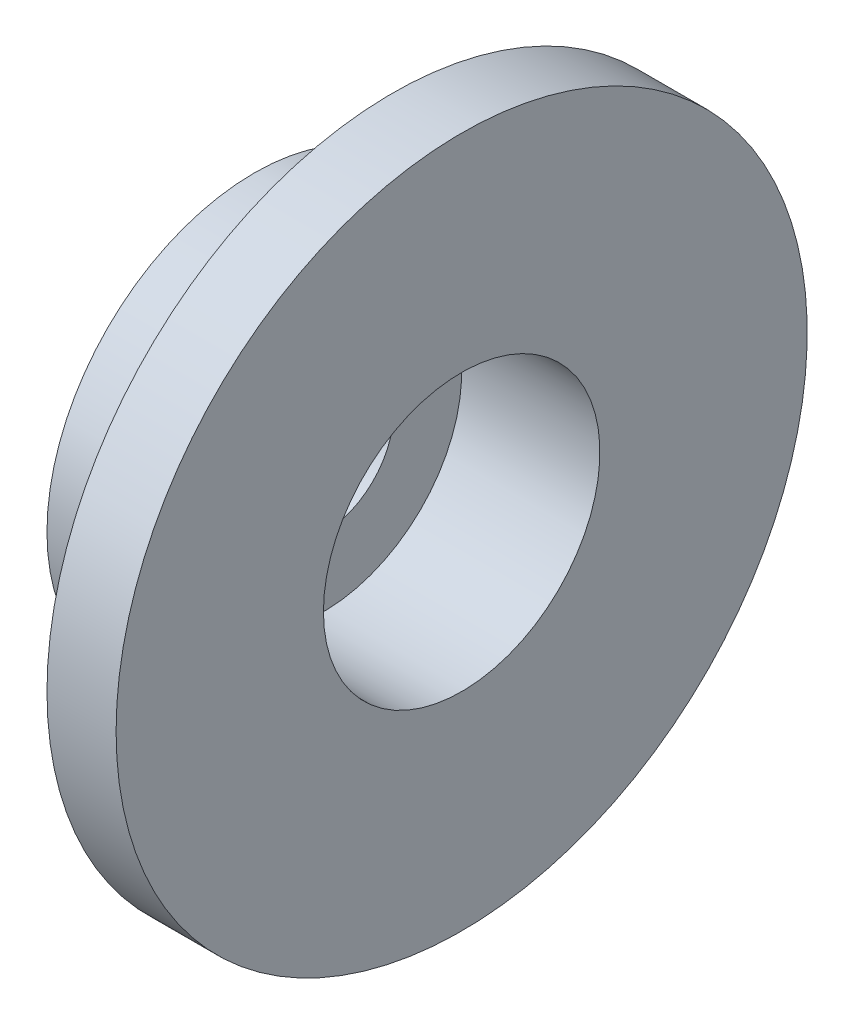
ISO-10303-21;
HEADER;
FILE_DESCRIPTION(('STEP AP214'),'2;1');
FILE_NAME('part.step','',(''),(''),'','','');
FILE_SCHEMA(('AUTOMOTIVE_DESIGN { 1 0 10303 214 1 1 1 1 }'));
ENDSEC;
DATA;
#1=APPLICATION_CONTEXT('core data for automotive mechanical design processes');
#2=APPLICATION_PROTOCOL_DEFINITION('international standard','automotive_design',2000,#1);
#3=PRODUCT_CONTEXT('',#1,'mechanical');
#4=PRODUCT('Part','Part','',(#3));
#5=PRODUCT_RELATED_PRODUCT_CATEGORY('part','',(#4));
#6=PRODUCT_DEFINITION_FORMATION('','',#4);
#7=PRODUCT_DEFINITION_CONTEXT('part definition',#1,'design');
#8=PRODUCT_DEFINITION('design','',#6,#7);
#9=PRODUCT_DEFINITION_SHAPE('','',#8);
#10=(LENGTH_UNIT() NAMED_UNIT(*) SI_UNIT(.MILLI.,.METRE.));
#11=(NAMED_UNIT(*) PLANE_ANGLE_UNIT() SI_UNIT($,.RADIAN.));
#12=(NAMED_UNIT(*) SI_UNIT($,.STERADIAN.) SOLID_ANGLE_UNIT());
#13=UNCERTAINTY_MEASURE_WITH_UNIT(LENGTH_MEASURE(1.E-05),#10,'distance_accuracy_value','');
#14=(GEOMETRIC_REPRESENTATION_CONTEXT(3) GLOBAL_UNCERTAINTY_ASSIGNED_CONTEXT((#13)) GLOBAL_UNIT_ASSIGNED_CONTEXT((#10,
#11,#12)) REPRESENTATION_CONTEXT('',''));
#15=CARTESIAN_POINT('',(0.,0.,0.));
#16=DIRECTION('',(0.,0.,1.));
#17=DIRECTION('',(1.,0.,0.));
#18=AXIS2_PLACEMENT_3D('',#15,#16,#17);
#19=CARTESIAN_POINT('',(0.,9.,0.));
#20=DIRECTION('',(1.,0.,0.));
#21=DIRECTION('',(0.,0.,-1.));
#22=AXIS2_PLACEMENT_3D('',#19,#20,#21);
#23=PLANE('',#22);
#24=CARTESIAN_POINT('',(0.,0.,0.));
#25=DIRECTION('',(-1.,0.,0.));
#26=DIRECTION('',(0.,0.,1.));
#27=AXIS2_PLACEMENT_3D('',#24,#25,#26);
#28=CIRCLE('',#27,9.);
#29=CARTESIAN_POINT('',(0.,0.,9.));
#30=VERTEX_POINT('',#29);
#31=EDGE_CURVE('E10',#30,#30,#28,.T.);
#32=ORIENTED_EDGE('',*,*,#31,.F.);
#33=EDGE_LOOP('',(#32));
#34=FACE_BOUND('',#33,.T.);
#35=CARTESIAN_POINT('',(0.,0.,0.));
#36=DIRECTION('',(-1.,0.,0.));
#37=DIRECTION('',(0.,0.,1.));
#38=AXIS2_PLACEMENT_3D('',#35,#36,#37);
#39=CIRCLE('',#38,15.);
#40=CARTESIAN_POINT('',(0.,0.,15.));
#41=VERTEX_POINT('',#40);
#42=EDGE_CURVE('E43',#41,#41,#39,.T.);
#43=ORIENTED_EDGE('',*,*,#42,.T.);
#44=EDGE_LOOP('',(#43));
#45=FACE_BOUND('',#44,.T.);
#46=ADVANCED_FACE('F15',(#34,#45),#23,.F.);
#47=CARTESIAN_POINT('',(47.5,0.,0.));
#48=DIRECTION('',(-1.,0.,0.));
#49=DIRECTION('',(0.,0.,1.));
#50=AXIS2_PLACEMENT_3D('',#47,#48,#49);
#51=CYLINDRICAL_SURFACE('',#50,9.);
#52=CARTESIAN_POINT('',(-6.,0.,0.));
#53=DIRECTION('',(-1.,0.,0.));
#54=DIRECTION('',(0.,0.,1.));
#55=AXIS2_PLACEMENT_3D('',#52,#53,#54);
#56=CIRCLE('',#55,9.);
#57=CARTESIAN_POINT('',(-6.,0.,9.));
#58=VERTEX_POINT('',#57);
#59=EDGE_CURVE('E21',#58,#58,#56,.T.);
#60=ORIENTED_EDGE('',*,*,#59,.F.);
#61=EDGE_LOOP('',(#60));
#62=FACE_BOUND('',#61,.T.);
#63=ORIENTED_EDGE('',*,*,#31,.T.);
#64=EDGE_LOOP('',(#63));
#65=FACE_BOUND('',#64,.T.);
#66=ADVANCED_FACE('F80',(#62,#65),#51,.T.);
#67=CARTESIAN_POINT('',(-6.,9.,0.));
#68=DIRECTION('',(1.,0.,0.));
#69=DIRECTION('',(0.,0.,-1.));
#70=AXIS2_PLACEMENT_3D('',#67,#68,#69);
#71=PLANE('',#70);
#72=CARTESIAN_POINT('',(-6.,0.,0.));
#73=DIRECTION('',(-1.,0.,0.));
#74=DIRECTION('',(0.,0.,1.));
#75=AXIS2_PLACEMENT_3D('',#72,#73,#74);
#76=CIRCLE('',#75,3.05);
#77=CARTESIAN_POINT('',(-6.,0.,3.05));
#78=VERTEX_POINT('',#77);
#79=EDGE_CURVE('E25',#78,#78,#76,.T.);
#80=ORIENTED_EDGE('',*,*,#79,.F.);
#81=EDGE_LOOP('',(#80));
#82=FACE_BOUND('',#81,.T.);
#83=ORIENTED_EDGE('',*,*,#59,.T.);
#84=EDGE_LOOP('',(#83));
#85=FACE_BOUND('',#84,.T.);
#86=ADVANCED_FACE('F75',(#82,#85),#71,.F.);
#87=CARTESIAN_POINT('',(47.5,0.,0.));
#88=DIRECTION('',(-1.,0.,0.));
#89=DIRECTION('',(0.,0.,1.));
#90=AXIS2_PLACEMENT_3D('',#87,#88,#89);
#91=CYLINDRICAL_SURFACE('',#90,3.05);
#92=CARTESIAN_POINT('',(-3.,0.,0.));
#93=DIRECTION('',(-1.,0.,0.));
#94=DIRECTION('',(0.,0.,1.));
#95=AXIS2_PLACEMENT_3D('',#92,#93,#94);
#96=CIRCLE('',#95,3.05);
#97=CARTESIAN_POINT('',(-3.,0.,3.05));
#98=VERTEX_POINT('',#97);
#99=EDGE_CURVE('E29',#98,#98,#96,.T.);
#100=ORIENTED_EDGE('',*,*,#99,.F.);
#101=EDGE_LOOP('',(#100));
#102=FACE_BOUND('',#101,.T.);
#103=ORIENTED_EDGE('',*,*,#79,.T.);
#104=EDGE_LOOP('',(#103));
#105=FACE_BOUND('',#104,.T.);
#106=ADVANCED_FACE('F69',(#102,#105),#91,.F.);
#107=CARTESIAN_POINT('',(-3.,3.05,0.));
#108=DIRECTION('',(-1.,0.,0.));
#109=DIRECTION('',(0.,0.,1.));
#110=AXIS2_PLACEMENT_3D('',#107,#108,#109);
#111=PLANE('',#110);
#112=CARTESIAN_POINT('',(-3.,0.,0.));
#113=DIRECTION('',(-1.,0.,0.));
#114=DIRECTION('',(0.,0.,1.));
#115=AXIS2_PLACEMENT_3D('',#112,#113,#114);
#116=CIRCLE('',#115,6.);
#117=CARTESIAN_POINT('',(-3.,0.,6.));
#118=VERTEX_POINT('',#117);
#119=EDGE_CURVE('E34',#118,#118,#116,.T.);
#120=ORIENTED_EDGE('',*,*,#119,.F.);
#121=EDGE_LOOP('',(#120));
#122=FACE_BOUND('',#121,.T.);
#123=ORIENTED_EDGE('',*,*,#99,.T.);
#124=EDGE_LOOP('',(#123));
#125=FACE_BOUND('',#124,.T.);
#126=ADVANCED_FACE('F63',(#122,#125),#111,.F.);
#127=CARTESIAN_POINT('',(47.5,0.,0.));
#128=DIRECTION('',(-1.,0.,0.));
#129=DIRECTION('',(0.,0.,1.));
#130=AXIS2_PLACEMENT_3D('',#127,#128,#129);
#131=CYLINDRICAL_SURFACE('',#130,6.);
#132=CARTESIAN_POINT('',(3.,0.,0.));
#133=DIRECTION('',(-1.,0.,0.));
#134=DIRECTION('',(0.,0.,1.));
#135=AXIS2_PLACEMENT_3D('',#132,#133,#134);
#136=CIRCLE('',#135,6.);
#137=CARTESIAN_POINT('',(3.,0.,6.));
#138=VERTEX_POINT('',#137);
#139=EDGE_CURVE('E37',#138,#138,#136,.T.);
#140=ORIENTED_EDGE('',*,*,#139,.F.);
#141=EDGE_LOOP('',(#140));
#142=FACE_BOUND('',#141,.T.);
#143=ORIENTED_EDGE('',*,*,#119,.T.);
#144=EDGE_LOOP('',(#143));
#145=FACE_BOUND('',#144,.T.);
#146=ADVANCED_FACE('F57',(#142,#145),#131,.F.);
#147=CARTESIAN_POINT('',(3.,15.,0.));
#148=DIRECTION('',(-1.,0.,0.));
#149=DIRECTION('',(0.,0.,1.));
#150=AXIS2_PLACEMENT_3D('',#147,#148,#149);
#151=PLANE('',#150);
#152=CARTESIAN_POINT('',(3.,0.,0.));
#153=DIRECTION('',(-1.,0.,0.));
#154=DIRECTION('',(0.,0.,1.));
#155=AXIS2_PLACEMENT_3D('',#152,#153,#154);
#156=CIRCLE('',#155,15.);
#157=CARTESIAN_POINT('',(3.,0.,15.));
#158=VERTEX_POINT('',#157);
#159=EDGE_CURVE('E40',#158,#158,#156,.T.);
#160=ORIENTED_EDGE('',*,*,#159,.F.);
#161=EDGE_LOOP('',(#160));
#162=FACE_BOUND('',#161,.T.);
#163=ORIENTED_EDGE('',*,*,#139,.T.);
#164=EDGE_LOOP('',(#163));
#165=FACE_BOUND('',#164,.T.);
#166=ADVANCED_FACE('F51',(#162,#165),#151,.F.);
#167=CARTESIAN_POINT('',(47.5,0.,0.));
#168=DIRECTION('',(-1.,0.,0.));
#169=DIRECTION('',(0.,0.,1.));
#170=AXIS2_PLACEMENT_3D('',#167,#168,#169);
#171=CYLINDRICAL_SURFACE('',#170,15.);
#172=ORIENTED_EDGE('',*,*,#42,.F.);
#173=EDGE_LOOP('',(#172));
#174=FACE_BOUND('',#173,.T.);
#175=ORIENTED_EDGE('',*,*,#159,.T.);
#176=EDGE_LOOP('',(#175));
#177=FACE_BOUND('',#176,.T.);
#178=ADVANCED_FACE('F48',(#174,#177),#171,.T.);
#179=CLOSED_SHELL('',(#46,#66,#86,#106,#126,#146,#166,#178));
#180=MANIFOLD_SOLID_BREP('B1',#179);
#181=ADVANCED_BREP_SHAPE_REPRESENTATION('',(#18,#180),#14);
#182=SHAPE_DEFINITION_REPRESENTATION(#9,#181);
ENDSEC;
END-ISO-10303-21;
